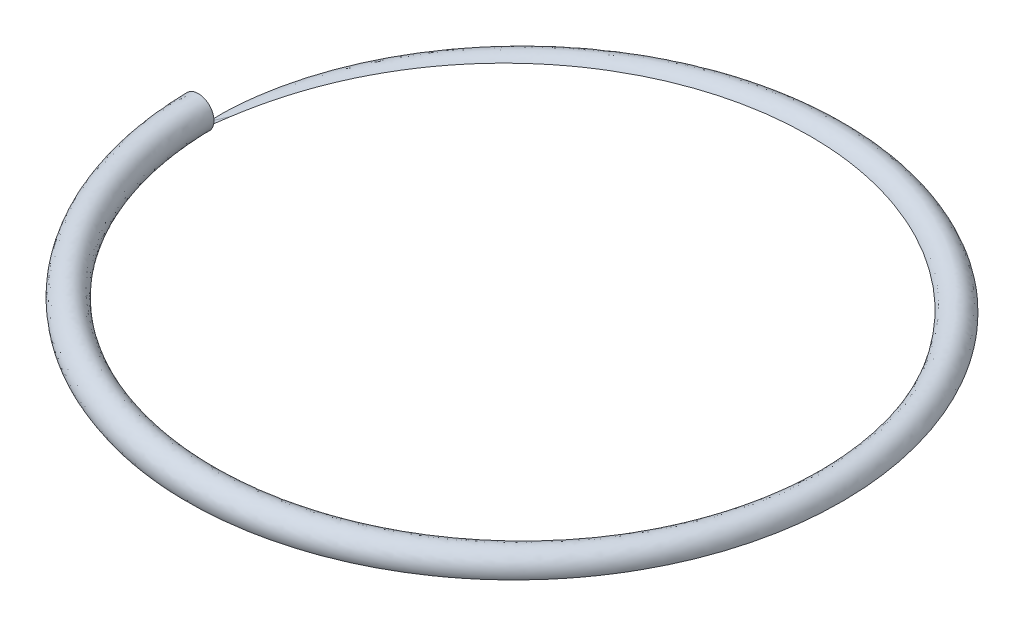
ISO-10303-21;
HEADER;
FILE_DESCRIPTION(('STEP AP214'),'2;1');
FILE_NAME('part.step','',(''),(''),'','','');
FILE_SCHEMA(('AUTOMOTIVE_DESIGN { 1 0 10303 214 1 1 1 1 }'));
ENDSEC;
DATA;
#1=APPLICATION_CONTEXT('core data for automotive mechanical design processes');
#2=APPLICATION_PROTOCOL_DEFINITION('international standard','automotive_design',2000,#1);
#3=PRODUCT_CONTEXT('',#1,'mechanical');
#4=PRODUCT('Part','Part','',(#3));
#5=PRODUCT_RELATED_PRODUCT_CATEGORY('part','',(#4));
#6=PRODUCT_DEFINITION_FORMATION('','',#4);
#7=PRODUCT_DEFINITION_CONTEXT('part definition',#1,'design');
#8=PRODUCT_DEFINITION('design','',#6,#7);
#9=PRODUCT_DEFINITION_SHAPE('','',#8);
#10=(LENGTH_UNIT() NAMED_UNIT(*) SI_UNIT(.MILLI.,.METRE.));
#11=(NAMED_UNIT(*) PLANE_ANGLE_UNIT() SI_UNIT($,.RADIAN.));
#12=(NAMED_UNIT(*) SI_UNIT($,.STERADIAN.) SOLID_ANGLE_UNIT());
#13=UNCERTAINTY_MEASURE_WITH_UNIT(LENGTH_MEASURE(1.E-05),#10,'distance_accuracy_value','');
#14=(GEOMETRIC_REPRESENTATION_CONTEXT(3) GLOBAL_UNCERTAINTY_ASSIGNED_CONTEXT((#13)) GLOBAL_UNIT_ASSIGNED_CONTEXT((#10,
#11,#12)) REPRESENTATION_CONTEXT('',''));
#15=CARTESIAN_POINT('',(0.,0.,0.));
#16=DIRECTION('',(0.,0.,1.));
#17=DIRECTION('',(1.,0.,0.));
#18=AXIS2_PLACEMENT_3D('',#15,#16,#17);
#19=CARTESIAN_POINT('',(-10.,0.5,0.));
#20=DIRECTION('',(0.,0.,1.));
#21=DIRECTION('',(1.,0.,0.));
#22=AXIS2_PLACEMENT_3D('',#19,#20,#21);
#23=PLANE('',#22);
#24=CARTESIAN_POINT('',(-10.,0.5,0.));
#25=DIRECTION('',(0.,0.,1.));
#26=DIRECTION('',(1.,0.,0.));
#27=AXIS2_PLACEMENT_3D('',#24,#25,#26);
#28=CIRCLE('',#27,0.499999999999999);
#29=CARTESIAN_POINT('',(-9.5,0.5,0.));
#30=VERTEX_POINT('',#29);
#31=CARTESIAN_POINT('',(-10.,0.,0.));
#32=VERTEX_POINT('',#31);
#33=EDGE_CURVE('E11',#30,#32,#28,.T.);
#34=ORIENTED_EDGE('',*,*,#33,.F.);
#35=EDGE_CURVE('E41',#32,#30,#28,.T.);
#36=ORIENTED_EDGE('',*,*,#35,.F.);
#37=EDGE_LOOP('',(#34,#36));
#38=FACE_BOUND('',#37,.T.);
#39=ADVANCED_FACE('F26',(#38),#23,.F.);
#40=CARTESIAN_POINT('',(-9.5,0.5,0.));
#41=CARTESIAN_POINT('',(-9.5,0.416583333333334,5.48482755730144));
#42=CARTESIAN_POINT('',(-4.75,0.333166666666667,8.22724133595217));
#43=CARTESIAN_POINT('',(0.,0.249750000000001,10.9696551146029));
#44=CARTESIAN_POINT('',(4.75,0.166333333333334,8.22724133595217));
#45=CARTESIAN_POINT('',(9.5,0.0829166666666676,5.48482755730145));
#46=CARTESIAN_POINT('',(9.5,-0.000499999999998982,0.));
#47=CARTESIAN_POINT('',(9.5,-0.0839166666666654,-5.48482755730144));
#48=CARTESIAN_POINT('',(4.75000000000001,-0.167333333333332,-8.22724133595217));
#49=CARTESIAN_POINT('',(0.,-0.250749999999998,-10.9696551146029));
#50=CARTESIAN_POINT('',(-4.74999999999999,-0.334166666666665,-8.22724133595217));
#51=CARTESIAN_POINT('',(-9.5,-0.417583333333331,-5.48482755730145));
#52=CARTESIAN_POINT('',(-9.5,-0.500999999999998,0.));
#53=CARTESIAN_POINT('',(-9.5,-0.584416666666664,5.48482755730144));
#54=CARTESIAN_POINT('',(-4.75,-0.667833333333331,8.22724133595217));
#55=CARTESIAN_POINT('',(0.,-0.751249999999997,10.9696551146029));
#56=CARTESIAN_POINT('',(4.75,-0.834666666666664,8.22724133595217));
#57=CARTESIAN_POINT('',(9.5,-0.91808333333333,5.48482755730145));
#58=CARTESIAN_POINT('',(9.5,-1.0015,0.));
#59=CARTESIAN_POINT('',(9.5,-1.08491666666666,-5.48482755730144));
#60=CARTESIAN_POINT('',(4.75000000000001,-1.16833333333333,-8.22724133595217));
#61=CARTESIAN_POINT('',(0.,-1.25175,-10.9696551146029));
#62=CARTESIAN_POINT('',(-4.74999999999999,-1.33516666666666,-8.22724133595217));
#63=CARTESIAN_POINT('',(-9.5,-1.41858333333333,-5.48482755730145));
#64=CARTESIAN_POINT('',(-9.5,-1.502,0.));
#65=CARTESIAN_POINT('',(-9.5,1.5,0.));
#66=CARTESIAN_POINT('',(-9.5,1.41658333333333,5.48482755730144));
#67=CARTESIAN_POINT('',(-4.75,1.33316666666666,8.22724133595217));
#68=CARTESIAN_POINT('',(0.,1.24975,10.9696551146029));
#69=CARTESIAN_POINT('',(4.75,1.16633333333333,8.22724133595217));
#70=CARTESIAN_POINT('',(9.5,1.08291666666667,5.48482755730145));
#71=CARTESIAN_POINT('',(9.5,0.999499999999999,0.));
#72=CARTESIAN_POINT('',(9.5,0.916083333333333,-5.48482755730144));
#73=CARTESIAN_POINT('',(4.75000000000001,0.832666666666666,-8.22724133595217));
#74=CARTESIAN_POINT('',(0.,0.749249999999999,-10.9696551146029));
#75=CARTESIAN_POINT('',(-4.74999999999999,0.665833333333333,-8.22724133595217));
#76=CARTESIAN_POINT('',(-9.5,0.582416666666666,-5.48482755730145));
#77=CARTESIAN_POINT('',(-9.5,0.499,0.));
#78=CARTESIAN_POINT('',(-9.5,0.415583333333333,5.48482755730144));
#79=CARTESIAN_POINT('',(-4.75,0.332166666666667,8.22724133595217));
#80=CARTESIAN_POINT('',(0.,0.24875,10.9696551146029));
#81=CARTESIAN_POINT('',(4.75,0.165333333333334,8.22724133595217));
#82=CARTESIAN_POINT('',(9.5,0.0819166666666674,5.48482755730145));
#83=CARTESIAN_POINT('',(9.5,-0.00149999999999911,0.));
#84=CARTESIAN_POINT('',(9.5,-0.0849166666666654,-5.48482755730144));
#85=CARTESIAN_POINT('',(4.75000000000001,-0.168333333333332,-8.22724133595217));
#86=CARTESIAN_POINT('',(0.,-0.251749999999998,-10.9696551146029));
#87=CARTESIAN_POINT('',(-4.74999999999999,-0.335166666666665,-8.22724133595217));
#88=CARTESIAN_POINT('',(-9.5,-0.418583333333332,-5.48482755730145));
#89=CARTESIAN_POINT('',(-9.5,-0.501999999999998,0.));
#90=CARTESIAN_POINT('',(-10.5,1.5,0.));
#91=CARTESIAN_POINT('',(-10.5,1.41658333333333,6.06217782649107));
#92=CARTESIAN_POINT('',(-5.25,1.33316666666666,9.0932667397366));
#93=CARTESIAN_POINT('',(0.,1.24975,12.1243556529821));
#94=CARTESIAN_POINT('',(5.25,1.16633333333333,9.09326673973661));
#95=CARTESIAN_POINT('',(10.5,1.08291666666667,6.06217782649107));
#96=CARTESIAN_POINT('',(10.5,0.999499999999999,0.));
#97=CARTESIAN_POINT('',(10.5,0.916083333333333,-6.06217782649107));
#98=CARTESIAN_POINT('',(5.25,0.832666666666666,-9.0932667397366));
#99=CARTESIAN_POINT('',(0.,0.749249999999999,-12.1243556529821));
#100=CARTESIAN_POINT('',(-5.24999999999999,0.665833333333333,-9.09326673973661));
#101=CARTESIAN_POINT('',(-10.5,0.582416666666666,-6.06217782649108));
#102=CARTESIAN_POINT('',(-10.5,0.499,0.));
#103=CARTESIAN_POINT('',(-10.5,0.415583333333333,6.06217782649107));
#104=CARTESIAN_POINT('',(-5.25,0.332166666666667,9.0932667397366));
#105=CARTESIAN_POINT('',(0.,0.24875,12.1243556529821));
#106=CARTESIAN_POINT('',(5.25,0.165333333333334,9.09326673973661));
#107=CARTESIAN_POINT('',(10.5,0.0819166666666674,6.06217782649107));
#108=CARTESIAN_POINT('',(10.5,-0.00149999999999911,0.));
#109=CARTESIAN_POINT('',(10.5,-0.0849166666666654,-6.06217782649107));
#110=CARTESIAN_POINT('',(5.25,-0.168333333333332,-9.0932667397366));
#111=CARTESIAN_POINT('',(0.,-0.251749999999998,-12.1243556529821));
#112=CARTESIAN_POINT('',(-5.24999999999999,-0.335166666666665,-9.09326673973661));
#113=CARTESIAN_POINT('',(-10.5,-0.418583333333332,-6.06217782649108));
#114=CARTESIAN_POINT('',(-10.5,-0.501999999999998,0.));
#115=CARTESIAN_POINT('',(-10.5,0.5,0.));
#116=CARTESIAN_POINT('',(-10.5,0.416583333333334,6.06217782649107));
#117=CARTESIAN_POINT('',(-5.25,0.333166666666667,9.0932667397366));
#118=CARTESIAN_POINT('',(0.,0.249750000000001,12.1243556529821));
#119=CARTESIAN_POINT('',(5.25,0.166333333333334,9.09326673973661));
#120=CARTESIAN_POINT('',(10.5,0.0829166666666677,6.06217782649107));
#121=CARTESIAN_POINT('',(10.5,-0.000499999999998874,0.));
#122=CARTESIAN_POINT('',(10.5,-0.0839166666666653,-6.06217782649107));
#123=CARTESIAN_POINT('',(5.25,-0.167333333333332,-9.0932667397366));
#124=CARTESIAN_POINT('',(0.,-0.250749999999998,-12.1243556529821));
#125=CARTESIAN_POINT('',(-5.24999999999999,-0.334166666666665,-9.09326673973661));
#126=CARTESIAN_POINT('',(-10.5,-0.417583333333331,-6.06217782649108));
#127=CARTESIAN_POINT('',(-10.5,-0.500999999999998,0.));
#128=CARTESIAN_POINT('',(-10.5,-0.584416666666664,6.06217782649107));
#129=CARTESIAN_POINT('',(-5.25,-0.667833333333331,9.0932667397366));
#130=CARTESIAN_POINT('',(0.,-0.751249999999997,12.1243556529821));
#131=CARTESIAN_POINT('',(5.25,-0.834666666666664,9.09326673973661));
#132=CARTESIAN_POINT('',(10.5,-0.91808333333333,6.06217782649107));
#133=CARTESIAN_POINT('',(10.5,-1.0015,0.));
#134=CARTESIAN_POINT('',(10.5,-1.08491666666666,-6.06217782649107));
#135=CARTESIAN_POINT('',(5.25,-1.16833333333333,-9.0932667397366));
#136=CARTESIAN_POINT('',(0.,-1.25175,-12.1243556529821));
#137=CARTESIAN_POINT('',(-5.24999999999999,-1.33516666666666,-9.09326673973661));
#138=CARTESIAN_POINT('',(-10.5,-1.41858333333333,-6.06217782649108));
#139=CARTESIAN_POINT('',(-10.5,-1.502,0.));
#140=CARTESIAN_POINT('',(-10.5,-0.499999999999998,0.));
#141=CARTESIAN_POINT('',(-10.5,-0.583416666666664,6.06217782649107));
#142=CARTESIAN_POINT('',(-5.25,-0.666833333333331,9.0932667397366));
#143=CARTESIAN_POINT('',(0.,-0.750249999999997,12.1243556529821));
#144=CARTESIAN_POINT('',(5.25,-0.833666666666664,9.09326673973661));
#145=CARTESIAN_POINT('',(10.5,-0.91708333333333,6.06217782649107));
#146=CARTESIAN_POINT('',(10.5,-1.0005,0.));
#147=CARTESIAN_POINT('',(10.5,-1.08391666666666,-6.06217782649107));
#148=CARTESIAN_POINT('',(5.25,-1.16733333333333,-9.0932667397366));
#149=CARTESIAN_POINT('',(0.,-1.25075,-12.1243556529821));
#150=CARTESIAN_POINT('',(-5.24999999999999,-1.33416666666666,-9.09326673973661));
#151=CARTESIAN_POINT('',(-10.5,-1.41758333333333,-6.06217782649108));
#152=CARTESIAN_POINT('',(-10.5,-1.501,0.));
#153=CARTESIAN_POINT('',(-10.5,-1.58441666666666,6.06217782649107));
#154=CARTESIAN_POINT('',(-5.25,-1.66783333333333,9.0932667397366));
#155=CARTESIAN_POINT('',(0.,-1.75125,12.1243556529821));
#156=CARTESIAN_POINT('',(5.25,-1.83466666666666,9.09326673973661));
#157=CARTESIAN_POINT('',(10.5,-1.91808333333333,6.06217782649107));
#158=CARTESIAN_POINT('',(10.5,-2.0015,0.));
#159=CARTESIAN_POINT('',(10.5,-2.08491666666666,-6.06217782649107));
#160=CARTESIAN_POINT('',(5.25,-2.16833333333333,-9.0932667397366));
#161=CARTESIAN_POINT('',(0.,-2.25174999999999,-12.1243556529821));
#162=CARTESIAN_POINT('',(-5.24999999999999,-2.33516666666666,-9.09326673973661));
#163=CARTESIAN_POINT('',(-10.5,-2.41858333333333,-6.06217782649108));
#164=CARTESIAN_POINT('',(-10.5,-2.50199999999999,0.));
#165=CARTESIAN_POINT('',(-9.5,-0.499999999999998,0.));
#166=CARTESIAN_POINT('',(-9.5,-0.583416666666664,5.48482755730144));
#167=CARTESIAN_POINT('',(-4.75,-0.666833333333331,8.22724133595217));
#168=CARTESIAN_POINT('',(0.,-0.750249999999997,10.9696551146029));
#169=CARTESIAN_POINT('',(4.75,-0.833666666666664,8.22724133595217));
#170=CARTESIAN_POINT('',(9.5,-0.91708333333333,5.48482755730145));
#171=CARTESIAN_POINT('',(9.5,-1.0005,0.));
#172=CARTESIAN_POINT('',(9.5,-1.08391666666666,-5.48482755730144));
#173=CARTESIAN_POINT('',(4.75000000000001,-1.16733333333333,-8.22724133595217));
#174=CARTESIAN_POINT('',(0.,-1.25075,-10.9696551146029));
#175=CARTESIAN_POINT('',(-4.74999999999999,-1.33416666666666,-8.22724133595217));
#176=CARTESIAN_POINT('',(-9.5,-1.41758333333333,-5.48482755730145));
#177=CARTESIAN_POINT('',(-9.5,-1.501,0.));
#178=CARTESIAN_POINT('',(-9.5,-1.58441666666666,5.48482755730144));
#179=CARTESIAN_POINT('',(-4.75,-1.66783333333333,8.22724133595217));
#180=CARTESIAN_POINT('',(0.,-1.75125,10.9696551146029));
#181=CARTESIAN_POINT('',(4.75,-1.83466666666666,8.22724133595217));
#182=CARTESIAN_POINT('',(9.5,-1.91808333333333,5.48482755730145));
#183=CARTESIAN_POINT('',(9.5,-2.00149999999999,0.));
#184=CARTESIAN_POINT('',(9.5,-2.08491666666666,-5.48482755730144));
#185=CARTESIAN_POINT('',(4.75000000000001,-2.16833333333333,-8.22724133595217));
#186=CARTESIAN_POINT('',(0.,-2.25174999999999,-10.9696551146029));
#187=CARTESIAN_POINT('',(-4.74999999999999,-2.33516666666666,-8.22724133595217));
#188=CARTESIAN_POINT('',(-9.5,-2.41858333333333,-5.48482755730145));
#189=CARTESIAN_POINT('',(-9.5,-2.50199999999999,0.));
#190=CARTESIAN_POINT('',(-9.5,0.5,0.));
#191=CARTESIAN_POINT('',(-9.5,0.416583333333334,5.48482755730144));
#192=CARTESIAN_POINT('',(-4.75,0.333166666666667,8.22724133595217));
#193=CARTESIAN_POINT('',(0.,0.249750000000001,10.9696551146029));
#194=CARTESIAN_POINT('',(4.75,0.166333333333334,8.22724133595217));
#195=CARTESIAN_POINT('',(9.5,0.0829166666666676,5.48482755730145));
#196=CARTESIAN_POINT('',(9.5,-0.000499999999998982,0.));
#197=CARTESIAN_POINT('',(9.5,-0.0839166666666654,-5.48482755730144));
#198=CARTESIAN_POINT('',(4.75000000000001,-0.167333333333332,-8.22724133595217));
#199=CARTESIAN_POINT('',(0.,-0.250749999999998,-10.9696551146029));
#200=CARTESIAN_POINT('',(-4.74999999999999,-0.334166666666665,-8.22724133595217));
#201=CARTESIAN_POINT('',(-9.5,-0.417583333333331,-5.48482755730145));
#202=CARTESIAN_POINT('',(-9.5,-0.500999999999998,0.));
#203=CARTESIAN_POINT('',(-9.5,-0.584416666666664,5.48482755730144));
#204=CARTESIAN_POINT('',(-4.75,-0.667833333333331,8.22724133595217));
#205=CARTESIAN_POINT('',(0.,-0.751249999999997,10.9696551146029));
#206=CARTESIAN_POINT('',(4.75,-0.834666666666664,8.22724133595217));
#207=CARTESIAN_POINT('',(9.5,-0.91808333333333,5.48482755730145));
#208=CARTESIAN_POINT('',(9.5,-1.0015,0.));
#209=CARTESIAN_POINT('',(9.5,-1.08491666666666,-5.48482755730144));
#210=CARTESIAN_POINT('',(4.75000000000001,-1.16833333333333,-8.22724133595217));
#211=CARTESIAN_POINT('',(0.,-1.25175,-10.9696551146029));
#212=CARTESIAN_POINT('',(-4.74999999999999,-1.33516666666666,-8.22724133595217));
#213=CARTESIAN_POINT('',(-9.5,-1.41858333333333,-5.48482755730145));
#214=CARTESIAN_POINT('',(-9.5,-1.502,0.));
#215=(BOUNDED_SURFACE() B_SPLINE_SURFACE(3,2,((#40,#41,#42,#43,#44,#45,#46,#47,#48,#49,#50,#51,
#52,#53,#54,#55,#56,#57,#58,#59,#60,#61,#62,#63,#64),(#65,#66,#67,#68,#69,#70,#71,#72,#73,#74,
#75,#76,#77,#78,#79,#80,#81,#82,#83,#84,#85,#86,#87,#88,#89),(#90,#91,#92,#93,#94,#95,#96,#97,
#98,#99,#100,#101,#102,#103,#104,#105,#106,#107,#108,#109,#110,#111,#112,#113,#114),(#115,#116,
#117,#118,#119,#120,#121,#122,#123,#124,#125,#126,#127,#128,#129,#130,#131,#132,#133,#134,#135,
#136,#137,#138,#139),(#140,#141,#142,#143,#144,#145,#146,#147,#148,#149,#150,#151,#152,#153,
#154,#155,#156,#157,#158,#159,#160,#161,#162,#163,#164),(#165,#166,#167,#168,#169,#170,#171,
#172,#173,#174,#175,#176,#177,#178,#179,#180,#181,#182,#183,#184,#185,#186,#187,#188,#189),
(#190,#191,#192,#193,#194,#195,#196,#197,#198,#199,#200,#201,#202,#203,#204,#205,#206,#207,#208,
#209,#210,#211,#212,#213,#214)),.UNSPECIFIED.,.T.,.F.,.F.) B_SPLINE_SURFACE_WITH_KNOTS((4,3,4),
(3,2,2,2,2,2,2,2,2,2,2,2,3),(0.,0.5,1.),(0.,0.0833333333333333,0.166666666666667,0.25,
0.333333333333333,0.416666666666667,0.5,0.583333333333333,0.666666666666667,0.75,
0.833333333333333,0.916666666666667,1.),
.UNSPECIFIED.) GEOMETRIC_REPRESENTATION_ITEM() RATIONAL_B_SPLINE_SURFACE(((1.,0.866025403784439,
1.,0.866025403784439,1.,0.866025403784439,1.,0.866025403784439,1.,0.866025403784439,1.,
0.866025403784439,1.,0.866025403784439,1.,0.866025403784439,1.,0.866025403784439,1.,
0.866025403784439,1.,0.866025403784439,1.,0.866025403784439,1.),(0.333333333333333,
0.288675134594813,0.333333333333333,0.288675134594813,0.333333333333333,0.288675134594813,
0.333333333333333,0.288675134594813,0.333333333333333,0.288675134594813,0.333333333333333,
0.288675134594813,0.333333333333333,0.288675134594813,0.333333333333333,0.288675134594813,
0.333333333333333,0.288675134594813,0.333333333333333,0.288675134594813,0.333333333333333,
0.288675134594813,0.333333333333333,0.288675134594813,0.333333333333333),(0.333333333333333,
0.288675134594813,0.333333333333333,0.288675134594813,0.333333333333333,0.288675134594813,
0.333333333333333,0.288675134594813,0.333333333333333,0.288675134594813,0.333333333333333,
0.288675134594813,0.333333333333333,0.288675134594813,0.333333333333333,0.288675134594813,
0.333333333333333,0.288675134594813,0.333333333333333,0.288675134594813,0.333333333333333,
0.288675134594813,0.333333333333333,0.288675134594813,0.333333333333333),(1.,0.866025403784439,
1.,0.866025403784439,1.,0.866025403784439,1.,0.866025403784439,1.,0.866025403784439,1.,
0.866025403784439,1.,0.866025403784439,1.,0.866025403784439,1.,0.866025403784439,1.,
0.866025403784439,1.,0.866025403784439,1.,0.866025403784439,1.),(0.333333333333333,
0.288675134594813,0.333333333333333,0.288675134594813,0.333333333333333,0.288675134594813,
0.333333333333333,0.288675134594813,0.333333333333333,0.288675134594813,0.333333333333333,
0.288675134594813,0.333333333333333,0.288675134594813,0.333333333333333,0.288675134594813,
0.333333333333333,0.288675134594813,0.333333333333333,0.288675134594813,0.333333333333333,
0.288675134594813,0.333333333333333,0.288675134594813,0.333333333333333),(0.333333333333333,
0.288675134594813,0.333333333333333,0.288675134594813,0.333333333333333,0.288675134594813,
0.333333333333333,0.288675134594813,0.333333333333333,0.288675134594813,0.333333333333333,
0.288675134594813,0.333333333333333,0.288675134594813,0.333333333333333,0.288675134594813,
0.333333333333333,0.288675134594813,0.333333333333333,0.288675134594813,0.333333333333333,
0.288675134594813,0.333333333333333,0.288675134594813,0.333333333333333),(1.,0.866025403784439,
1.,0.866025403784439,1.,0.866025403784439,1.,0.866025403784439,1.,0.866025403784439,1.,
0.866025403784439,1.,0.866025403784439,1.,0.866025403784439,1.,0.866025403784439,1.,
0.866025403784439,1.,0.866025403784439,1.,0.866025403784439,1.))) REPRESENTATION_ITEM('') SURFACE());
#216=CARTESIAN_POINT('',(-10.,0.,0.));
#217=CARTESIAN_POINT('',(-9.99899214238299,1.92400996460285E-13,2.5138704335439E-06));
#218=CARTESIAN_POINT('',(-9.99798089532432,-1.74047329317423E-13,0.000225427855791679));
#219=CARTESIAN_POINT('',(-9.99586309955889,2.19772474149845E-13,0.00108249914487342));
#220=CARTESIAN_POINT('',(-9.99479950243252,1.2958245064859E-12,0.00180807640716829));
#221=CARTESIAN_POINT('',(-9.99196995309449,2.5162059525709E-12,0.00421517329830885));
#222=CARTESIAN_POINT('',(-9.99046014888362,8.87742874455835E-13,0.00616139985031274));
#223=CARTESIAN_POINT('',(-9.98655838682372,-1.67322378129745E-12,0.012032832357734));
#224=CARTESIAN_POINT('',(-9.9845680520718,-7.14724678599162E-13,0.0161852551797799));
#225=CARTESIAN_POINT('',(-9.98099402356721,7.19324428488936E-13,0.0246750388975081));
#226=CARTESIAN_POINT('',(-9.97941302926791,1.191726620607E-12,0.0290134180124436));
#227=CARTESIAN_POINT('',(-9.97506310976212,1.54948492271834E-12,0.0420301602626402));
#228=CARTESIAN_POINT('',(-9.97263631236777,4.15442472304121E-13,0.0508214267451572));
#229=CARTESIAN_POINT('',(-9.96817451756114,-4.15988208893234E-13,0.0685041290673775));
#230=CARTESIAN_POINT('',(-9.96614003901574,-1.11487254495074E-13,0.07739568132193));
#231=CARTESIAN_POINT('',(-9.96232057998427,1.11159720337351E-13,0.0952059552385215));
#232=CARTESIAN_POINT('',(-9.96053488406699,0.,0.104124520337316));
#233=CARTESIAN_POINT('',(-9.95712013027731,0.,0.121984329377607));
#234=CARTESIAN_POINT('',(-9.95549096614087,0.,0.13092555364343));
#235=CARTESIAN_POINT('',(-9.95077636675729,0.,0.157705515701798));
#236=CARTESIAN_POINT('',(-9.94784946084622,0.,0.175572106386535));
#237=CARTESIAN_POINT('',(-9.94222162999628,0.,0.211341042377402));
#238=CARTESIAN_POINT('',(-9.93952072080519,0.,0.229243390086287));
#239=CARTESIAN_POINT('',(-9.93160660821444,0.,0.282992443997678));
#240=CARTESIAN_POINT('',(-9.92658429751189,0.,0.318867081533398));
#241=CARTESIAN_POINT('',(-9.91666730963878,0.,0.390649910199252));
#242=CARTESIAN_POINT('',(-9.91177269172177,0.,0.426558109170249));
#243=CARTESIAN_POINT('',(-9.90195322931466,0.,0.498365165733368));
#244=CARTESIAN_POINT('',(-9.89702838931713,0.,0.534264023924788));
#245=CARTESIAN_POINT('',(-9.88203638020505,0.,0.64206082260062));
#246=CARTESIAN_POINT('',(-9.87176849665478,0.,0.713931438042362));
#247=CARTESIAN_POINT('',(-9.85030013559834,0.,0.857533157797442));
#248=CARTESIAN_POINT('',(-9.8390996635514,0.,0.929264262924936));
#249=CARTESIAN_POINT('',(-9.80380315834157,0.,1.1441782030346));
#250=CARTESIAN_POINT('',(-9.77801107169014,0.,1.28708896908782));
#251=CARTESIAN_POINT('',(-9.7211703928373,0.,1.57190790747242));
#252=CARTESIAN_POINT('',(-9.690120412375,0.,1.71381580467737));
#253=CARTESIAN_POINT('',(-9.62248863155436,0.,1.99633862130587));
#254=CARTESIAN_POINT('',(-9.58590542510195,0.,2.13695320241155));
#255=CARTESIAN_POINT('',(-9.46710071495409,0.,2.55830434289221));
#256=CARTESIAN_POINT('',(-9.37619487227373,0.,2.8366560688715));
#257=CARTESIAN_POINT('',(-9.17114420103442,0.,3.38473276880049));
#258=CARTESIAN_POINT('',(-9.05699292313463,0.,3.65445532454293));
#259=CARTESIAN_POINT('',(-8.80570113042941,0.,4.1835030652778));
#260=CARTESIAN_POINT('',(-8.66852529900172,0.,4.4428115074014));
#261=CARTESIAN_POINT('',(-8.37209844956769,0.,4.94848529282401));
#262=CARTESIAN_POINT('',(-8.21284801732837,0.,5.19485097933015));
#263=CARTESIAN_POINT('',(-7.87594685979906,0.,5.66896931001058));
#264=CARTESIAN_POINT('',(-7.69861739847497,0.,5.89695022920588));
#265=CARTESIAN_POINT('',(-7.32480872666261,0.,6.33663503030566));
#266=CARTESIAN_POINT('',(-7.12832961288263,0.,6.54833899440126));
#267=CARTESIAN_POINT('',(-6.71771827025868,0.,6.95370027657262));
#268=CARTESIAN_POINT('',(-6.50359344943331,0.,7.14736509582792));
#269=CARTESIAN_POINT('',(-6.0592035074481,0.,7.51518566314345));
#270=CARTESIAN_POINT('',(-5.82893841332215,0.,7.68934144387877));
#271=CARTESIAN_POINT('',(-5.36197165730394,0.,8.01125507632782));
#272=CARTESIAN_POINT('',(-5.1257478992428,0.,8.15970440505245));
#273=CARTESIAN_POINT('',(-4.76256503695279,0.,8.36685336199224));
#274=CARTESIAN_POINT('',(-4.63998817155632,0.,8.4333346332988));
#275=CARTESIAN_POINT('',(-4.3920634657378,0.,8.5609115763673));
#276=CARTESIAN_POINT('',(-4.26671563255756,0.,8.62200726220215));
#277=CARTESIAN_POINT('',(-3.88692532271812,0.,8.79704574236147));
#278=CARTESIAN_POINT('',(-3.62864609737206,0.,8.90279125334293));
#279=CARTESIAN_POINT('',(-3.10406195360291,0.,9.09149098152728));
#280=CARTESIAN_POINT('',(-2.83776071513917,0.,9.17445547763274));
#281=CARTESIAN_POINT('',(-2.30463019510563,0.,9.31556758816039));
#282=CARTESIAN_POINT('',(-2.03792907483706,0.,9.37419910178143));
#283=CARTESIAN_POINT('',(-1.50052949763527,0.,9.46867992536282));
#284=CARTESIAN_POINT('',(-1.22983114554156,0.,9.5045298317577));
#285=CARTESIAN_POINT('',(-0.686356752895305,0.,9.55318901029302));
#286=CARTESIAN_POINT('',(-0.413580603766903,0.,9.56599706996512));
#287=CARTESIAN_POINT('',(0.132078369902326,0.,9.56846707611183));
#288=CARTESIAN_POINT('',(0.404961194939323,0.,9.55812891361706));
#289=CARTESIAN_POINT('',(0.947549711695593,0.,9.51447477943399));
#290=CARTESIAN_POINT('',(1.21726439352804,0.,9.4812704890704));
#291=CARTESIAN_POINT('',(1.75293581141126,0.,9.39222265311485));
#292=CARTESIAN_POINT('',(2.01889248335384,0.,9.33637872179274));
#293=CARTESIAN_POINT('',(2.54512712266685,0.,9.20243777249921));
#294=CARTESIAN_POINT('',(2.80540539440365,0.,9.12434195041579));
#295=CARTESIAN_POINT('',(3.31843476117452,0.,8.94643449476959));
#296=CARTESIAN_POINT('',(3.57118578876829,0.,8.84662266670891));
#297=CARTESIAN_POINT('',(4.06683474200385,0.,8.62621031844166));
#298=CARTESIAN_POINT('',(4.30975176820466,0.,8.50565274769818));
#299=CARTESIAN_POINT('',(4.78452619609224,0.,8.24443723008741));
#300=CARTESIAN_POINT('',(5.01638377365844,0.,8.1037796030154));
#301=CARTESIAN_POINT('',(5.46728326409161,0.,7.80325206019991));
#302=CARTESIAN_POINT('',(5.68632566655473,0.,7.64338287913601));
#303=CARTESIAN_POINT('',(6.11004466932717,0.,7.3056218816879));
#304=CARTESIAN_POINT('',(6.31472119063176,0.,7.12772996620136));
#305=CARTESIAN_POINT('',(6.70697037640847,0.,6.75640109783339));
#306=CARTESIAN_POINT('',(6.89464404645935,0.,6.56307082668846));
#307=CARTESIAN_POINT('',(7.25301353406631,0.,6.16127484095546));
#308=CARTESIAN_POINT('',(7.42370971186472,0.,5.95280944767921));
#309=CARTESIAN_POINT('',(7.74692056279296,0.,5.52221865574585));
#310=CARTESIAN_POINT('',(7.89943454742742,0.,5.30009274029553));
#311=CARTESIAN_POINT('',(8.18518794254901,0.,4.8437705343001));
#312=CARTESIAN_POINT('',(8.31842733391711,0.,4.60957423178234));
#313=CARTESIAN_POINT('',(8.56454290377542,0.,4.13104615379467));
#314=CARTESIAN_POINT('',(8.67744161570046,0.,3.88672596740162));
#315=CARTESIAN_POINT('',(8.88225128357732,0.,3.38944170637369));
#316=CARTESIAN_POINT('',(8.97416226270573,0.,3.13647764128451));
#317=CARTESIAN_POINT('',(9.13633288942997,0.,2.62371287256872));
#318=CARTESIAN_POINT('',(9.20659339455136,0.,2.36391244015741));
#319=CARTESIAN_POINT('',(9.32495976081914,0.,1.83930748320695));
#320=CARTESIAN_POINT('',(9.37306521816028,0.,1.57450286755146));
#321=CARTESIAN_POINT('',(9.44674767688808,0.,1.04191371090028));
#322=CARTESIAN_POINT('',(9.47233604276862,0.,0.774130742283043));
#323=CARTESIAN_POINT('',(9.50082779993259,0.,0.237360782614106));
#324=CARTESIAN_POINT('',(9.5037312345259,0.,-0.0316262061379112));
#325=CARTESIAN_POINT('',(9.48682875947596,0.,-0.568885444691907));
#326=CARTESIAN_POINT('',(9.46702285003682,0.,-0.83715769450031));
#327=CARTESIAN_POINT('',(9.40485950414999,0.,-1.37107651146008));
#328=CARTESIAN_POINT('',(9.36250204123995,0.,-1.63672307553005));
#329=CARTESIAN_POINT('',(9.25561771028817,0.,-2.16315760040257));
#330=CARTESIAN_POINT('',(9.19111975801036,0.,-2.42395143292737));
#331=CARTESIAN_POINT('',(9.04041015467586,0.,-2.93918705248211));
#332=CARTESIAN_POINT('',(8.95419854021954,0.,-3.1936288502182));
#333=CARTESIAN_POINT('',(8.76067753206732,0.,-3.69436555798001));
#334=CARTESIAN_POINT('',(8.65336762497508,0.,-3.9406602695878));
#335=CARTESIAN_POINT('',(8.41841649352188,0.,-4.42335345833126));
#336=CARTESIAN_POINT('',(8.2907752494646,0.,-4.6597519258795));
#337=CARTESIAN_POINT('',(8.01586426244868,0.,-5.1213212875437));
#338=CARTESIAN_POINT('',(7.86856572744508,0.,-5.3464750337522));
#339=CARTESIAN_POINT('',(7.55553197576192,0.,-5.78358002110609));
#340=CARTESIAN_POINT('',(7.38979669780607,0.,-5.99553121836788));
#341=CARTESIAN_POINT('',(7.04107354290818,0.,-6.40471391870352));
#342=CARTESIAN_POINT('',(6.8580864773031,0.,-6.6019461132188));
#343=CARTESIAN_POINT('',(6.47614848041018,0.,-6.98029514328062));
#344=CARTESIAN_POINT('',(6.27719754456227,0.,-7.16141197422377));
#345=CARTESIAN_POINT('',(5.86469985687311,0.,-7.50627968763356));
#346=CARTESIAN_POINT('',(5.65114995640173,0.,-7.67002680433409));
#347=CARTESIAN_POINT('',(5.21099272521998,0.,-7.97891440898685));
#348=CARTESIAN_POINT('',(4.98438538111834,0.,-8.12405487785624));
#349=CARTESIAN_POINT('',(4.51976448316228,0.,-8.39476901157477));
#350=CARTESIAN_POINT('',(4.28175057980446,0.,-8.52034207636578));
#351=CARTESIAN_POINT('',(3.79604686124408,0.,-8.75112523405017));
#352=CARTESIAN_POINT('',(3.54835698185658,0.,-8.85633519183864));
#353=CARTESIAN_POINT('',(3.04451835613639,0.,-9.04584605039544));
#354=CARTESIAN_POINT('',(2.78835318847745,0.,-9.13010329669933));
#355=CARTESIAN_POINT('',(2.26986546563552,0.,-9.2768547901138));
#356=CARTESIAN_POINT('',(2.00754294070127,0.,-9.33934914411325));
#357=CARTESIAN_POINT('',(1.4785748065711,0.,-9.44215344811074));
#358=CARTESIAN_POINT('',(1.21192901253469,0.,-9.48246244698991));
#359=CARTESIAN_POINT('',(0.676199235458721,0.,-9.54062435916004));
#360=CARTESIAN_POINT('',(0.40711524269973,0.,-9.55847718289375));
#361=CARTESIAN_POINT('',(-0.133183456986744,0.,-9.5716523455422));
#362=CARTESIAN_POINT('',(-0.404401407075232,0.,-9.56684198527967));
#363=CARTESIAN_POINT('',(-0.945472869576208,0.,-9.53443099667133));
#364=CARTESIAN_POINT('',(-1.21532637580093,0.,-9.50683026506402));
#365=CARTESIAN_POINT('',(-1.75173548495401,0.,-9.42904449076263));
#366=CARTESIAN_POINT('',(-2.01829135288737,0.,-9.37886127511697));
#367=CARTESIAN_POINT('',(-2.54623943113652,0.,-9.25627045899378));
#368=CARTESIAN_POINT('',(-2.80763174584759,0.,-9.18386330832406));
#369=CARTESIAN_POINT('',(-3.32389497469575,0.,-9.01717806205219));
#370=CARTESIAN_POINT('',(-3.57875232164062,0.,-8.9228580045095));
#371=CARTESIAN_POINT('',(-4.07965106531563,0.,-8.71308079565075));
#372=CARTESIAN_POINT('',(-4.32569257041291,0.,-8.597623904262));
#373=CARTESIAN_POINT('',(-4.68673221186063,0.,-8.40920595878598));
#374=CARTESIAN_POINT('',(-4.80575675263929,0.,-8.34385163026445));
#375=CARTESIAN_POINT('',(-5.0409861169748,0.,-8.20825523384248));
#376=CARTESIAN_POINT('',(-5.15719096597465,0.,-8.13801321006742));
#377=CARTESIAN_POINT('',(-5.50128503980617,0.,-7.9201508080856));
#378=CARTESIAN_POINT('',(-5.72469760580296,0.,-7.76537119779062));
#379=CARTESIAN_POINT('',(-6.15929468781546,0.,-7.43688468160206));
#380=CARTESIAN_POINT('',(-6.37039433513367,0.,-7.26306584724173));
#381=CARTESIAN_POINT('',(-6.7774714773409,0.,-6.89853740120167));
#382=CARTESIAN_POINT('',(-6.97344919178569,0.,-6.70782803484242));
#383=CARTESIAN_POINT('',(-7.34906002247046,0.,-6.31082044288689));
#384=CARTESIAN_POINT('',(-7.52868740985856,0.,-6.10451679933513));
#385=CARTESIAN_POINT('',(-7.87037968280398,0.,-5.67785193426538));
#386=CARTESIAN_POINT('',(-8.03244468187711,0.,-5.45749080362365));
#387=CARTESIAN_POINT('',(-8.34124361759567,0.,-4.99950343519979));
#388=CARTESIAN_POINT('',(-8.48758377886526,1.01148304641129E-13,-4.76161168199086));
#389=CARTESIAN_POINT('',(-8.7600815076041,-1.01150881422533E-13,-4.27453407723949));
#390=CARTESIAN_POINT('',(-8.88623856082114,-3.77778862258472E-13,-4.02534793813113));
#391=CARTESIAN_POINT('',(-9.11755412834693,3.77130308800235E-13,-3.51795160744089));
#392=CARTESIAN_POINT('',(-9.22274832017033,1.40642247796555E-12,-3.25975764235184));
#393=CARTESIAN_POINT('',(-9.41207651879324,-1.40570117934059E-12,-2.73588126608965));
#394=CARTESIAN_POINT('',(-9.49622129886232,-5.24461928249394E-12,-2.47020276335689));
#395=CARTESIAN_POINT('',(-9.58963451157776,-7.45413905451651E-13,-2.13032925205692));
#396=CARTESIAN_POINT('',(-9.60853660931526,7.24068092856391E-13,-2.05868887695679));
#397=CARTESIAN_POINT('',(-9.64489589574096,-7.23800866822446E-13,-1.91506838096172));
#398=CARTESIAN_POINT('',(-9.66235361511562,-3.63953301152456E-12,-1.84308839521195));
#399=CARTESIAN_POINT('',(-9.71584645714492,-7.35176648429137E-12,-1.61266963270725));
#400=CARTESIAN_POINT('',(-9.74918020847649,-1.46331953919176E-12,-1.4535957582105));
#401=CARTESIAN_POINT('',(-9.79675718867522,8.40350447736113E-13,-1.20227229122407));
#402=CARTESIAN_POINT('',(-9.81308597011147,2.21469198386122E-13,-1.11040691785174));
#403=CARTESIAN_POINT('',(-9.84393814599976,-2.21469504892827E-13,-0.926373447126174));
#404=CARTESIAN_POINT('',(-9.85846153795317,0.,-0.834205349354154));
#405=CARTESIAN_POINT('',(-9.88137954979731,0.,-0.682002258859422));
#406=CARTESIAN_POINT('',(-9.89013892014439,0.,-0.622020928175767));
#407=CARTESIAN_POINT('',(-9.90744598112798,0.,-0.501997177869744));
#408=CARTESIAN_POINT('',(-9.91599356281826,0.,-0.441954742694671));
#409=CARTESIAN_POINT('',(-9.92959270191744,0.,-0.349873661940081));
#410=CARTESIAN_POINT('',(-9.93442056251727,-1.02198421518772E-13,-0.317803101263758));
#411=CARTESIAN_POINT('',(-9.94208268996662,0.,-0.269782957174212));
#412=CARTESIAN_POINT('',(-9.94470513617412,1.39398624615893E-13,-0.253799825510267));
#413=CARTESIAN_POINT('',(-9.95018634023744,-1.39342095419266E-13,-0.221879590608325));
#414=CARTESIAN_POINT('',(-9.95304500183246,-5.06257067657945E-13,-0.205942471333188));
#415=CARTESIAN_POINT('',(-9.95766242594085,-2.81009225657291E-13,-0.182082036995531));
#416=CARTESIAN_POINT('',(-9.95925841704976,0.,-0.174127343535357));
#417=CARTESIAN_POINT('',(-9.96261034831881,0.,-0.158242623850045));
#418=CARTESIAN_POINT('',(-9.96436644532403,0.,-0.150312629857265));
#419=CARTESIAN_POINT('',(-9.96813697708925,0.,-0.134458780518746));
#420=CARTESIAN_POINT('',(-9.97015305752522,0.,-0.126535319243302));
#421=CARTESIAN_POINT('',(-9.97459702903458,0.,-0.110811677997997));
#422=CARTESIAN_POINT('',(-9.9770240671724,0.,-0.103011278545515));
#423=CARTESIAN_POINT('',(-9.98138917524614,0.,-0.0915762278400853));
#424=CARTESIAN_POINT('',(-9.98296431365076,0.,-0.0878100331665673));
#425=CARTESIAN_POINT('',(-9.98569252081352,0.,-0.0823553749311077));
#426=CARTESIAN_POINT('',(-9.98665709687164,0.,-0.0805780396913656));
#427=CARTESIAN_POINT('',(-9.98877504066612,0.,-0.0771438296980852));
#428=CARTESIAN_POINT('',(-9.98992857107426,-2.72889616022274E-13,-0.0754870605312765));
#429=CARTESIAN_POINT('',(-9.99260598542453,2.74395641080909E-13,-0.072403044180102));
#430=CARTESIAN_POINT('',(-9.99413197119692,1.02518163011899E-12,-0.070977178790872));
#431=CARTESIAN_POINT('',(-9.99674778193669,-4.54768468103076E-13,-0.0696377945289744));
#432=CARTESIAN_POINT('',(-9.99760609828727,-1.25600729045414E-12,-0.0693243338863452));
#433=CARTESIAN_POINT('',(-9.9993911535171,-1.19474419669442E-12,-0.0690279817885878));
#434=CARTESIAN_POINT('',(-10.0003182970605,-3.21505630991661E-13,-0.0690472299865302));
#435=CARTESIAN_POINT('',(-10.0020172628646,2.72654488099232E-13,-0.0693954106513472));
#436=CARTESIAN_POINT('',(-10.0027955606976,0.,-0.0696965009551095));
#437=CARTESIAN_POINT('',(-10.0048070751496,-1.6595145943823E-13,-0.0707582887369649));
#438=CARTESIAN_POINT('',(-10.0059397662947,0.,-0.0716943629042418));
#439=CARTESIAN_POINT('',(-10.0083263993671,0.,-0.0741059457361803));
#440=CARTESIAN_POINT('',(-10.00949285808,0.,-0.0756569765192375));
#441=CARTESIAN_POINT('',(-10.0116190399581,0.,-0.0789026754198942));
#442=CARTESIAN_POINT('',(-10.0125773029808,0.,-0.0805982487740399));
#443=CARTESIAN_POINT('',(-10.015253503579,0.,-0.0857921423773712));
#444=CARTESIAN_POINT('',(-10.016768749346,0.,-0.089391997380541));
#445=CARTESIAN_POINT('',(-10.0195313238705,0.,-0.096694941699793));
#446=CARTESIAN_POINT('',(-10.020777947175,0.,-0.100398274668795));
#447=CARTESIAN_POINT('',(-10.0242611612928,0.,-0.111590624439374));
#448=CARTESIAN_POINT('',(-10.0262399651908,0.,-0.119159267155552));
#449=CARTESIAN_POINT('',(-10.0316247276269,0.,-0.14182161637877));
#450=CARTESIAN_POINT('',(-10.0345305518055,0.,-0.157026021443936));
#451=CARTESIAN_POINT('',(-10.0397077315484,0.,-0.187556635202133));
#452=CARTESIAN_POINT('',(-10.0419781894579,0.,-0.202882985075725));
#453=CARTESIAN_POINT('',(-10.0460907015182,0.,-0.233565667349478));
#454=CARTESIAN_POINT('',(-10.0479334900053,0.,-0.248921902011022));
#455=CARTESIAN_POINT('',(-10.0513091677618,0.,-0.27965751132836));
#456=CARTESIAN_POINT('',(-10.0528422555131,0.,-0.295036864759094));
#457=CARTESIAN_POINT('',(-10.0570726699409,0.,-0.341168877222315));
#458=CARTESIAN_POINT('',(-10.059406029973,0.,-0.371954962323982));
#459=CARTESIAN_POINT('',(-10.0633638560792,0.,-0.433573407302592));
#460=CARTESIAN_POINT('',(-10.0649882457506,0.,-0.464405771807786));
#461=CARTESIAN_POINT('',(-10.0689949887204,0.,-0.556972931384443));
#462=CARTESIAN_POINT('',(-10.0705083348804,0.,-0.618745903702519));
#463=CARTESIAN_POINT('',(-10.0717172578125,0.,-0.742383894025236));
#464=CARTESIAN_POINT('',(-10.0714104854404,0.,-0.804248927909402));
#465=CARTESIAN_POINT('',(-10.0691864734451,0.,-0.927935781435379));
#466=CARTESIAN_POINT('',(-10.0672695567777,0.,-0.989757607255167));
#467=CARTESIAN_POINT('',(-10.0593165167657,0.,-1.17488869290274));
#468=CARTESIAN_POINT('',(-10.0510792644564,0.,-1.29810891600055));
#469=CARTESIAN_POINT('',(-10.0292648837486,0.,-1.54408233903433));
#470=CARTESIAN_POINT('',(-10.0156866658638,0.,-1.66683543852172));
#471=CARTESIAN_POINT('',(-9.96733876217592,0.,-2.03428289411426));
#472=CARTESIAN_POINT('',(-9.92496309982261,0.,-2.27801497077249));
#473=CARTESIAN_POINT('',(-9.82119862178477,0.,-2.76144971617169));
#474=CARTESIAN_POINT('',(-9.75980172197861,0.,-3.00115062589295));
#475=CARTESIAN_POINT('',(-9.61881753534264,0.,-3.47506829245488));
#476=CARTESIAN_POINT('',(-9.53923556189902,0.,-3.70928662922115));
#477=CARTESIAN_POINT('',(-9.36388551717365,0.,-4.16765968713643));
#478=CARTESIAN_POINT('',(-9.26837042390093,0.,-4.39191135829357));
#479=CARTESIAN_POINT('',(-9.06105136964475,0.,-4.83275644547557));
#480=CARTESIAN_POINT('',(-8.94924715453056,0.,-5.04934974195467));
#481=CARTESIAN_POINT('',(-8.71009944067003,0.,-5.47369909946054));
#482=CARTESIAN_POINT('',(-8.58276019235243,0.,-5.68145755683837));
#483=CARTESIAN_POINT('',(-8.31323236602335,0.,-6.0872096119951));
#484=CARTESIAN_POINT('',(-8.17103865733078,0.,-6.28519980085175));
#485=CARTESIAN_POINT('',(-7.87266891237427,0.,-6.67031231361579));
#486=CARTESIAN_POINT('',(-7.71649437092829,0.,-6.85743579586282));
#487=CARTESIAN_POINT('',(-7.39105903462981,0.,-7.2198495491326));
#488=CARTESIAN_POINT('',(-7.22180143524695,0.,-7.39514269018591));
#489=CARTESIAN_POINT('',(-6.87113088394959,0.,-7.7330255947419));
#490=CARTESIAN_POINT('',(-6.68972101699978,0.,-7.89561855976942));
#491=CARTESIAN_POINT('',(-6.31556140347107,0.,-8.20744126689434));
#492=CARTESIAN_POINT('',(-6.1228041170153,0.,-8.35666195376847));
#493=CARTESIAN_POINT('',(-5.72511992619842,0.,-8.64228289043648));
#494=CARTESIAN_POINT('',(-5.52009248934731,0.,-8.77854357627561));
#495=CARTESIAN_POINT('',(-5.20558729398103,0.,-8.97153243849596));
#496=CARTESIAN_POINT('',(-5.09957346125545,0.,-9.03397107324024));
#497=CARTESIAN_POINT('',(-4.88537204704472,0.,-9.15504689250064));
#498=CARTESIAN_POINT('',(-4.77718407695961,0.,-9.2136833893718));
#499=CARTESIAN_POINT('',(-4.44957144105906,0.,-9.38374565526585));
#500=CARTESIAN_POINT('',(-4.2270796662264,0.,-9.48933547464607));
#501=CARTESIAN_POINT('',(-3.77514987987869,0.,-9.68436430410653));
#502=CARTESIAN_POINT('',(-3.54571160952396,0.,-9.77380271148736));
#503=CARTESIAN_POINT('',(-3.04407361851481,0.,-9.94898357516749));
#504=CARTESIAN_POINT('',(-2.77087344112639,0.,-10.031879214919));
#505=CARTESIAN_POINT('',(-2.21862769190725,0.,-10.174777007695));
#506=CARTESIAN_POINT('',(-1.93958343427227,0.,-10.2347842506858));
#507=CARTESIAN_POINT('',(-1.37761670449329,0.,-10.3315088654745));
#508=CARTESIAN_POINT('',(-1.09469608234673,0.,-10.3682369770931));
#509=CARTESIAN_POINT('',(-0.526466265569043,0.,-10.4182302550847));
#510=CARTESIAN_POINT('',(-0.241154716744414,0.,-10.4314686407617));
#511=CARTESIAN_POINT('',(0.33344210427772,0.,-10.4343390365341));
#512=CARTESIAN_POINT('',(0.6227290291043,0.,-10.4236499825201));
#513=CARTESIAN_POINT('',(1.19951671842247,0.,-10.3780814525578));
#514=CARTESIAN_POINT('',(1.48701665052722,0.,-10.3431914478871));
#515=CARTESIAN_POINT('',(2.05810580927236,0.,-10.2494669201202));
#516=CARTESIAN_POINT('',(2.34169477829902,0.,-10.1906308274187));
#517=CARTESIAN_POINT('',(2.9028319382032,0.,-10.0494737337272));
#518=CARTESIAN_POINT('',(3.18038276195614,0.,-9.96716319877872));
#519=CARTESIAN_POINT('',(3.72574901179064,0.,-9.78028862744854));
#520=CARTESIAN_POINT('',(3.99361835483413,0.,-9.67588188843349));
#521=CARTESIAN_POINT('',(4.51943481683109,0.,-9.44536371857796));
#522=CARTESIAN_POINT('',(4.77739436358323,0.,-9.31928063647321));
#523=CARTESIAN_POINT('',(5.28129422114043,0.,-9.04660303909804));
#524=CARTESIAN_POINT('',(5.52726621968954,0.,-8.90006705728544));
#525=CARTESIAN_POINT('',(6.00713289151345,0.,-8.58682864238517));
#526=CARTESIAN_POINT('',(6.2409866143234,-1.36901473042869E-13,-8.4200634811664));
#527=CARTESIAN_POINT('',(6.69426639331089,1.36963483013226E-13,-8.06775293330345));
#528=CARTESIAN_POINT('',(6.9136858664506,5.11412571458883E-13,-7.88219907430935));
#529=CARTESIAN_POINT('',(7.33648867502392,4.58706949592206E-13,-7.49364028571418));
#530=CARTESIAN_POINT('',(7.53987140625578,0.,-7.29063469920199));
#531=CARTESIAN_POINT('',(7.92912791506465,0.,-6.86862631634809));
#532=CARTESIAN_POINT('',(8.11501069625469,3.32242080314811E-13,-6.64963185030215));
#533=CARTESIAN_POINT('',(8.379504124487,2.08596231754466E-13,-6.31063142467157));
#534=CARTESIAN_POINT('',(8.46516225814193,0.,-6.19605964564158));
#535=CARTESIAN_POINT('',(8.63170670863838,0.,-5.96348046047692));
#536=CARTESIAN_POINT('',(8.71259254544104,0.,-5.84547271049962));
#537=CARTESIAN_POINT('',(8.94838611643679,0.,-5.48581478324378));
#538=CARTESIAN_POINT('',(9.09587258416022,0.,-5.23924422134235));
#539=CARTESIAN_POINT('',(9.37001263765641,0.,-4.73478152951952));
#540=CARTESIAN_POINT('',(9.49666619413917,0.,-4.47688938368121));
#541=CARTESIAN_POINT('',(9.67017039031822,0.,-4.08338051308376));
#542=CARTESIAN_POINT('',(9.72518506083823,0.,-3.9513131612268));
#543=CARTESIAN_POINT('',(9.82973625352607,0.,-3.68504432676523));
#544=CARTESIAN_POINT('',(9.87927334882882,0.,-3.55084306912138));
#545=CARTESIAN_POINT('',(10.0198408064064,0.,-3.14449968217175));
#546=CARTESIAN_POINT('',(10.1024815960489,0.,-2.86940207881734));
#547=CARTESIAN_POINT('',(10.2448566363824,0.,-2.3132189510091));
#548=CARTESIAN_POINT('',(10.3045785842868,0.,-2.0321302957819));
#549=CARTESIAN_POINT('',(10.4006736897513,0.,-1.46599245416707));
#550=CARTESIAN_POINT('',(10.4370470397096,0.,-1.18094330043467));
#551=CARTESIAN_POINT('',(10.4861904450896,0.,-0.608938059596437));
#552=CARTESIAN_POINT('',(10.4989730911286,0.,-0.321983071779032));
#553=CARTESIAN_POINT('',(10.5004227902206,0.,0.107982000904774));
#554=CARTESIAN_POINT('',(10.4979688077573,0.,0.251012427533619));
#555=CARTESIAN_POINT('',(10.4871964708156,0.,0.536867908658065));
#556=CARTESIAN_POINT('',(10.4788775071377,0.,0.679692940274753));
#557=CARTESIAN_POINT('',(10.4450594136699,0.,1.1084186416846));
#558=CARTESIAN_POINT('',(10.4106959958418,0.,1.39366613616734));
#559=CARTESIAN_POINT('',(10.3185946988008,0.,1.96036224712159));
#560=CARTESIAN_POINT('',(10.2608568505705,0.,2.24181086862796));
#561=CARTESIAN_POINT('',(10.1571494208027,0.,2.6591766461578));
#562=CARTESIAN_POINT('',(10.1198023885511,0.,2.79728357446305));
#563=CARTESIAN_POINT('',(10.0394720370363,0.,3.07183216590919));
#564=CARTESIAN_POINT('',(9.99648929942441,0.,3.20827399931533));
#565=CARTESIAN_POINT('',(9.85889135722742,0.,3.61563354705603));
#566=CARTESIAN_POINT('',(9.75583329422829,0.,3.88375266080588));
#567=CARTESIAN_POINT('',(9.52792665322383,0.,4.41069789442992));
#568=CARTESIAN_POINT('',(9.40306642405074,0.,4.66951895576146));
#569=CARTESIAN_POINT('',(9.13243436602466,0.,5.17598824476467));
#570=CARTESIAN_POINT('',(8.98666245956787,0.,5.423636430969));
#571=CARTESIAN_POINT('',(8.67525644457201,0.,5.9059649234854));
#572=CARTESIAN_POINT('',(8.5096330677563,0.,6.14065213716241));
#573=CARTESIAN_POINT('',(8.24744286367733,0.,6.48143255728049));
#574=CARTESIAN_POINT('',(8.15789812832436,0.,6.59299206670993));
#575=CARTESIAN_POINT('',(7.97428951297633,0.,6.81235022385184));
#576=CARTESIAN_POINT('',(7.88022512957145,0.,6.92014845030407));
#577=CARTESIAN_POINT('',(7.59086010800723,0.,7.23830786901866));
#578=CARTESIAN_POINT('',(7.38894227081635,0.,7.44271284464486));
#579=CARTESIAN_POINT('',(6.96895311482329,0.,7.83417512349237));
#580=CARTESIAN_POINT('',(6.7508824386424,0.,8.02123311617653));
#581=CARTESIAN_POINT('',(6.4132134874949,0.,8.28753714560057));
#582=CARTESIAN_POINT('',(6.29908838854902,0.,8.3737975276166));
#583=CARTESIAN_POINT('',(6.06738720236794,0.,8.54156095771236));
#584=CARTESIAN_POINT('',(5.94981098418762,0.,8.62306382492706));
#585=CARTESIAN_POINT('',(5.59139503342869,0.,8.86077717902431));
#586=CARTESIAN_POINT('',(5.34560623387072,0.,9.00961032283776));
#587=CARTESIAN_POINT('',(4.84259551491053,0.,9.28641767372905));
#588=CARTESIAN_POINT('',(4.58537533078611,0.,9.41439503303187));
#589=CARTESIAN_POINT('',(4.19278259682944,0.,9.58981545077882));
#590=CARTESIAN_POINT('',(4.06102001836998,0.,9.64545104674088));
#591=CARTESIAN_POINT('',(3.79524432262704,0.,9.75125855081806));
#592=CARTESIAN_POINT('',(3.66123011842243,0.,9.80142772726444));
#593=CARTESIAN_POINT('',(3.25162367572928,0.,9.94517278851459));
#594=CARTESIAN_POINT('',(2.97290320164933,0.,10.0300008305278));
#595=CARTESIAN_POINT('',(2.40917364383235,0.,10.1759433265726));
#596=CARTESIAN_POINT('',(2.12416072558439,0.,10.2370428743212));
#597=CARTESIAN_POINT('',(1.54983466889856,0.,10.3350470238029));
#598=CARTESIAN_POINT('',(1.2605192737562,0.,10.3719384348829));
#599=CARTESIAN_POINT('',(0.679950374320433,0.,10.421178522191));
#600=CARTESIAN_POINT('',(0.388697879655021,0.,10.4335391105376));
#601=CARTESIAN_POINT('',(-0.189649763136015,0.,10.433653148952));
#602=CARTESIAN_POINT('',(-0.476744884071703,0.,10.4217554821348));
#603=CARTESIAN_POINT('',(-1.04890953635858,0.,10.3741277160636));
#604=CARTESIAN_POINT('',(-1.33397935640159,0.,10.33840108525));
#605=CARTESIAN_POINT('',(-1.90365168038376,0.,10.2427721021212));
#606=CARTESIAN_POINT('',(-2.18820512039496,0.,10.1825772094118));
#607=CARTESIAN_POINT('',(-2.7513536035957,0.,10.0384042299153));
#608=CARTESIAN_POINT('',(-3.02994598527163,0.,9.95441574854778));
#609=CARTESIAN_POINT('',(-3.57910095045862,0.,9.76325065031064));
#610=CARTESIAN_POINT('',(-3.8496624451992,0.,9.65607090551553));
#611=CARTESIAN_POINT('',(-4.38067566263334,0.,9.41934491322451));
#612=CARTESIAN_POINT('',(-4.64113169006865,0.,9.28980832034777));
#613=CARTESIAN_POINT('',(-5.14670793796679,0.,9.01120817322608));
#614=CARTESIAN_POINT('',(-5.39199018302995,0.,8.86243873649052));
#615=CARTESIAN_POINT('',(-5.86901144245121,0.,8.5447753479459));
#616=CARTESIAN_POINT('',(-6.10075640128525,2.29105240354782E-13,8.37589032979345));
#617=CARTESIAN_POINT('',(-6.54750651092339,2.2760732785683E-13,8.02046291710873));
#618=CARTESIAN_POINT('',(-6.76262207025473,0.,7.83405926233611));
#619=CARTESIAN_POINT('',(-7.17648340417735,0.,7.44374202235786));
#620=CARTESIAN_POINT('',(-7.37522333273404,0.,7.23982223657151));
#621=CARTESIAN_POINT('',(-7.75514646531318,0.,6.81551396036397));
#622=CARTESIAN_POINT('',(-7.93629464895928,0.,6.59509410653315));
#623=CARTESIAN_POINT('',(-8.27926849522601,0.,6.13958403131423));
#624=CARTESIAN_POINT('',(-8.44108780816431,0.,5.90448902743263));
#625=CARTESIAN_POINT('',(-8.74358516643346,0.,5.42208349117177));
#626=CARTESIAN_POINT('',(-8.88432722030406,0.,5.17481310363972));
#627=CARTESIAN_POINT('',(-9.14416878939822,0.,4.66897377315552));
#628=CARTESIAN_POINT('',(-9.26325670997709,0.,4.41039886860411));
#629=CARTESIAN_POINT('',(-9.47828175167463,0.,3.88468905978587));
#630=CARTESIAN_POINT('',(-9.57428590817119,-2.7165472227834E-13,3.61758155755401));
#631=CARTESIAN_POINT('',(-9.74252861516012,2.7157776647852E-13,3.07600583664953));
#632=CARTESIAN_POINT('',(-9.81477389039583,1.01340319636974E-12,2.80153972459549));
#633=CARTESIAN_POINT('',(-9.90416286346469,5.5859698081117E-13,2.38711941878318));
#634=CARTESIAN_POINT('',(-9.93072008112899,1.50929356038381E-13,2.24913985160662));
#635=CARTESIAN_POINT('',(-9.97750522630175,-1.50845434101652E-13,1.97218457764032));
#636=CARTESIAN_POINT('',(-9.99773666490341,0.,1.83320946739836));
#637=CARTESIAN_POINT('',(-10.0372380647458,0.,1.50844846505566));
#638=CARTESIAN_POINT('',(-10.0539887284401,0.,1.32234565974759));
#639=CARTESIAN_POINT('',(-10.0713028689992,0.,1.01110058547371));
#640=CARTESIAN_POINT('',(-10.0753874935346,0.,0.886150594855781));
#641=CARTESIAN_POINT('',(-10.0766724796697,0.,0.677222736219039));
#642=CARTESIAN_POINT('',(-10.0756924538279,0.,0.593258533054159));
#643=CARTESIAN_POINT('',(-10.0709415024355,0.,0.452900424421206));
#644=CARTESIAN_POINT('',(-10.0681887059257,0.,0.396474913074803));
#645=CARTESIAN_POINT('',(-10.0622942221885,0.,0.311537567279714));
#646=CARTESIAN_POINT('',(-10.0600119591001,0.,0.282966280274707));
#647=CARTESIAN_POINT('',(-10.0546650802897,0.,0.225894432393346));
#648=CARTESIAN_POINT('',(-10.0516005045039,0.,0.19739386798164));
#649=CARTESIAN_POINT('',(-10.0460697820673,0.,0.15460360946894));
#650=CARTESIAN_POINT('',(-10.0440572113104,0.,0.140256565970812));
#651=CARTESIAN_POINT('',(-10.0395742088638,0.,0.111635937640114));
#652=CARTESIAN_POINT('',(-10.0371038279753,-2.52418679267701E-13,0.097362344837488));
#653=CARTESIAN_POINT('',(-10.0314050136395,2.61567977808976E-13,0.0687110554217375));
#654=CARTESIAN_POINT('',(-10.0281648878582,9.7236375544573E-13,0.0543354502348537));
#655=CARTESIAN_POINT('',(-10.0218569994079,-4.98045412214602E-13,0.0329394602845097));
#656=CARTESIAN_POINT('',(-10.019470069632,-1.44214535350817E-12,0.0257383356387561));
#657=CARTESIAN_POINT('',(-10.0148595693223,7.58634255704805E-13,0.015138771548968));
#658=CARTESIAN_POINT('',(-10.0130961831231,2.17543139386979E-12,0.0115576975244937));
#659=CARTESIAN_POINT('',(-10.0097025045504,-1.1791824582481E-12,0.00642523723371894));
#660=CARTESIAN_POINT('',(-10.0083808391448,-3.41461363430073E-12,0.00469517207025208));
#661=CARTESIAN_POINT('',(-10.0060261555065,1.70799657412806E-12,0.00247241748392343));
#662=CARTESIAN_POINT('',(-10.0051790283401,4.82959658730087E-12,0.00179346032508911));
#663=CARTESIAN_POINT('',(-10.003296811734,4.33523577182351E-12,0.000693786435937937));
#664=CARTESIAN_POINT('',(-10.0022600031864,6.54593982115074E-13,0.000275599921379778));
#665=CARTESIAN_POINT('',(-10.0007933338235,-2.38229518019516E-13,3.22053097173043E-05));
#666=CARTESIAN_POINT('',(-10.0003969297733,0.,-9.90050583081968E-07));
#667=CARTESIAN_POINT('',(-10.,0.,0.));
#668=B_SPLINE_CURVE_WITH_KNOTS('',3,(#216,#217,#218,#219,#220,#221,#222,#223,#224,#225,#226,
#227,#228,#229,#230,#231,#232,#233,#234,#235,#236,#237,#238,#239,#240,#241,#242,#243,#244,#245,
#246,#247,#248,#249,#250,#251,#252,#253,#254,#255,#256,#257,#258,#259,#260,#261,#262,#263,#264,
#265,#266,#267,#268,#269,#270,#271,#272,#273,#274,#275,#276,#277,#278,#279,#280,#281,#282,#283,
#284,#285,#286,#287,#288,#289,#290,#291,#292,#293,#294,#295,#296,#297,#298,#299,#300,#301,#302,
#303,#304,#305,#306,#307,#308,#309,#310,#311,#312,#313,#314,#315,#316,#317,#318,#319,#320,#321,
#322,#323,#324,#325,#326,#327,#328,#329,#330,#331,#332,#333,#334,#335,#336,#337,#338,#339,#340,
#341,#342,#343,#344,#345,#346,#347,#348,#349,#350,#351,#352,#353,#354,#355,#356,#357,#358,#359,
#360,#361,#362,#363,#364,#365,#366,#367,#368,#369,#370,#371,#372,#373,#374,#375,#376,#377,#378,
#379,#380,#381,#382,#383,#384,#385,#386,#387,#388,#389,#390,#391,#392,#393,#394,#395,#396,#397,
#398,#399,#400,#401,#402,#403,#404,#405,#406,#407,#408,#409,#410,#411,#412,#413,#414,#415,#416,
#417,#418,#419,#420,#421,#422,#423,#424,#425,#426,#427,#428,#429,#430,#431,#432,#433,#434,#435,
#436,#437,#438,#439,#440,#441,#442,#443,#444,#445,#446,#447,#448,#449,#450,#451,#452,#453,#454,
#455,#456,#457,#458,#459,#460,#461,#462,#463,#464,#465,#466,#467,#468,#469,#470,#471,#472,#473,
#474,#475,#476,#477,#478,#479,#480,#481,#482,#483,#484,#485,#486,#487,#488,#489,#490,#491,#492,
#493,#494,#495,#496,#497,#498,#499,#500,#501,#502,#503,#504,#505,#506,#507,#508,#509,#510,#511,
#512,#513,#514,#515,#516,#517,#518,#519,#520,#521,#522,#523,#524,#525,#526,#527,#528,#529,#530,
#531,#532,#533,#534,#535,#536,#537,#538,#539,#540,#541,#542,#543,#544,#545,#546,#547,#548,#549,
#550,#551,#552,#553,#554,#555,#556,#557,#558,#559,#560,#561,#562,#563,#564,#565,#566,#567,#568,
#569,#570,#571,#572,#573,#574,#575,#576,#577,#578,#579,#580,#581,#582,#583,#584,#585,#586,#587,
#588,#589,#590,#591,#592,#593,#594,#595,#596,#597,#598,#599,#600,#601,#602,#603,#604,#605,#606,
#607,#608,#609,#610,#611,#612,#613,#614,#615,#616,#617,#618,#619,#620,#621,#622,#623,#624,#625,
#626,#627,#628,#629,#630,#631,#632,#633,#634,#635,#636,#637,#638,#639,#640,#641,#642,#643,#644,
#645,#646,#647,#648,#649,#650,#651,#652,#653,#654,#655,#656,#657,#658,#659,#660,#661,#662,#663,
#664,#665,#666,#667),.UNSPECIFIED.,.T.,.F.,(4,2,2,2,2,2,2,2,2,2,2,2,2,2,2,2,2,2,2,2,2,2,2,2,2,2,
2,2,2,2,2,2,2,2,2,2,2,2,2,2,2,2,2,2,2,2,2,2,2,2,2,2,2,2,2,2,2,2,2,2,2,2,2,2,2,2,2,2,2,2,2,2,2,2,
2,2,2,2,2,2,2,2,2,2,2,2,2,2,2,2,2,2,2,2,2,2,2,2,2,2,2,2,2,2,2,2,2,2,2,2,2,2,2,2,2,2,2,2,2,2,2,2,
2,2,2,2,2,2,2,2,2,2,2,2,2,2,2,2,2,2,2,2,2,2,2,2,2,2,2,2,2,2,2,2,2,2,2,2,2,2,2,2,2,2,2,2,2,2,2,2,
2,2,2,2,2,2,2,2,2,2,2,2,2,2,2,2,2,2,2,2,2,2,2,2,2,2,2,2,2,2,2,2,2,2,2,2,2,2,2,2,2,2,2,2,2,2,2,2,
2,2,2,2,2,2,2,4),(0.,0.00301803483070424,0.00681632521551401,0.0141153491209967,
0.0278732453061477,0.0417196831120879,0.069047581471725,0.0964113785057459,0.123694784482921,
0.150959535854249,0.205270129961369,0.259584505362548,0.368256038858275,0.476977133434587,
0.585682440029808,0.803478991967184,1.02127426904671,1.4568427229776,1.89252636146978,
2.32832090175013,3.20567786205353,4.08327857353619,4.96223792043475,5.84117394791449,
6.7065693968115,7.57196047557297,8.43699007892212,9.30201823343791,10.1379153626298,
10.5561364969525,10.9743565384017,11.8104870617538,12.6462396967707,13.464467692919,
14.2826742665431,15.1009238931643,15.9191773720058,16.7334624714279,17.547761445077,
18.3620166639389,19.1762791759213,19.9888757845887,20.8014594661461,21.6140120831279,
22.4265691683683,23.2339301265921,24.0412739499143,24.8486483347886,25.6560235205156,
26.4624987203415,27.2689730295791,28.0754153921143,28.8818724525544,29.6879222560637,
30.4939705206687,31.3000187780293,32.1060679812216,32.9110684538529,33.7160675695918,
34.5210862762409,35.3261057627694,36.1323175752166,36.9385320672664,37.7447086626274,
38.5508854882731,39.3572367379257,40.1635888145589,40.96996561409,41.7763477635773,
42.5843961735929,43.3924406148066,44.2005196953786,45.0086019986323,45.8214217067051,
46.6342450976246,47.4470027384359,48.2597439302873,49.0740544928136,49.8883550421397,
50.2956122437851,50.7028657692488,51.517224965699,52.3366585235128,53.156080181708,
53.9757878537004,54.7954902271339,55.6324193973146,56.4693698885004,57.3048835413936,
58.1399686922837,58.3622375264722,58.5844243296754,59.071848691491,59.3517490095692,
59.6316497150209,59.8135017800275,59.9954455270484,60.0927385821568,60.1413284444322,
60.1898986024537,60.2142374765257,60.2386004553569,60.2631260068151,60.287601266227,
60.2998306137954,60.3058847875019,60.3119442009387,60.3180386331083,60.3207335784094,
60.3234458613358,60.3259156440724,60.3302512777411,60.3360460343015,60.3418802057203,
60.3535691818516,60.3652884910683,60.388735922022,60.435145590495,60.4816204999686,
60.5280150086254,60.5743796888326,60.6669897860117,60.759609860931,60.9449459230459,
61.1305212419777,61.3160593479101,61.6864002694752,62.0568167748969,62.7981002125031,
63.5396991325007,64.2810816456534,65.0116520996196,65.7422339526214,66.4726163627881,
67.2032518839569,67.9338093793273,68.6641890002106,69.3943839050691,70.1250695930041,
70.8628970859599,71.2319328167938,71.6010351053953,72.3391751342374,73.077342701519,
73.9328345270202,74.7881359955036,75.6430425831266,76.4989232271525,77.3663570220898,
78.2341684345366,79.10203673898,79.9695187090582,80.8310213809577,81.691405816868,
82.5493765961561,83.4100793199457,84.2711719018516,85.1322969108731,85.9929764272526,
86.4220300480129,86.8511267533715,87.712029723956,88.5729339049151,89.0020312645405,
89.431083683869,90.291751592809,91.1528808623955,92.0140030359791,92.8746654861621,
93.3037164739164,93.7328120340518,94.5937061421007,95.4545991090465,95.8836957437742,
96.3127481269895,97.1734189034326,98.034551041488,98.8956863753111,99.756358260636,
100.185409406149,100.614508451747,101.475426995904,102.336311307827,102.765377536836,
103.194460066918,104.055436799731,104.916283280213,105.34525656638,105.774443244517,
106.647349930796,107.520804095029,108.394733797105,109.268239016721,110.129270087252,
110.990175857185,111.86169235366,112.733590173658,113.605605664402,114.477245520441,
115.336857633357,116.196089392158,117.049012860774,117.902239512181,118.757131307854,
119.612303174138,120.464822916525,121.317797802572,122.168264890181,123.018491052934,
123.439905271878,123.861085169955,124.421219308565,124.796123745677,125.047969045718,
125.217408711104,125.303389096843,125.389365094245,125.432821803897,125.476273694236,
125.520433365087,125.543141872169,125.555072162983,125.561540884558,125.56477650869,
125.568043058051,125.569231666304),.UNSPECIFIED.);
#669=EDGE_CURVE('E33',#32,#32,#668,.T.);
#670=ORIENTED_EDGE('',*,*,#33,.T.);
#671=ORIENTED_EDGE('',*,*,#669,.F.);
#672=ORIENTED_EDGE('',*,*,#35,.T.);
#673=EDGE_LOOP('',(#670,#671,#672));
#674=FACE_BOUND('',#673,.T.);
#675=ADVANCED_FACE('F28',(#674),#215,.T.);
#676=CARTESIAN_POINT('',(-36.0532221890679,0.,-30.));
#677=DIRECTION('',(0.,1.,0.));
#678=DIRECTION('',(0.,0.,1.));
#679=AXIS2_PLACEMENT_3D('',#676,#677,#678);
#680=PLANE('',#679);
#681=ORIENTED_EDGE('',*,*,#669,.T.);
#682=EDGE_LOOP('',(#681));
#683=FACE_BOUND('',#682,.T.);
#684=ADVANCED_FACE('F52',(#683),#680,.F.);
#685=CLOSED_SHELL('',(#39,#675,#684));
#686=MANIFOLD_SOLID_BREP('B2',#685);
#687=ADVANCED_BREP_SHAPE_REPRESENTATION('',(#18,#686),#14);
#688=SHAPE_DEFINITION_REPRESENTATION(#9,#687);
ENDSEC;
END-ISO-10303-21;
